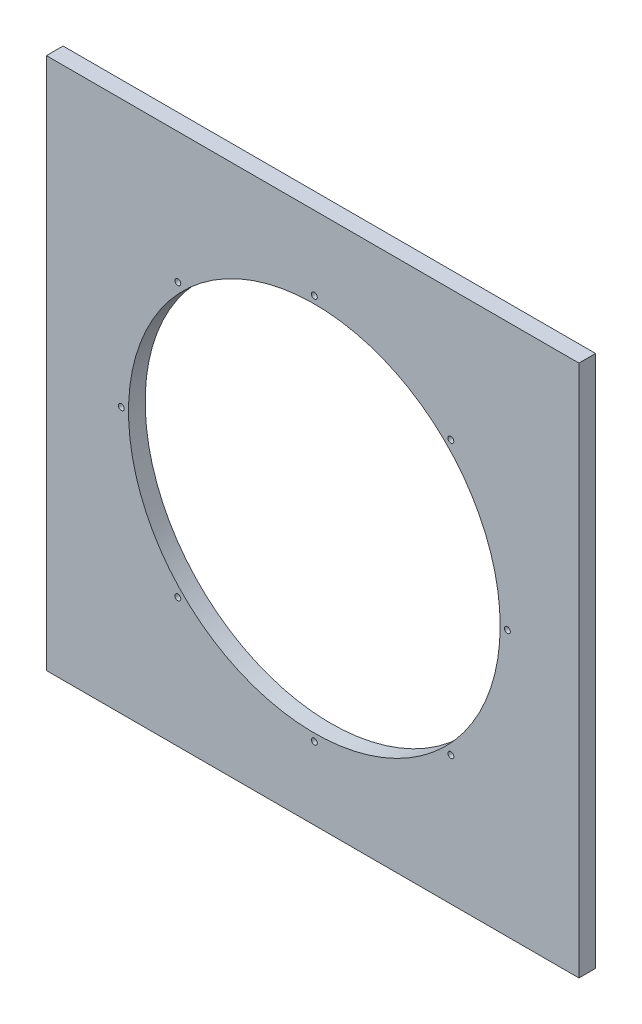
ISO-10303-21;
HEADER;
FILE_DESCRIPTION(('STEP AP214'),'2;1');
FILE_NAME('part.step','',(''),(''),'','','');
FILE_SCHEMA(('AUTOMOTIVE_DESIGN { 1 0 10303 214 1 1 1 1 }'));
ENDSEC;
DATA;
#1=APPLICATION_CONTEXT('core data for automotive mechanical design processes');
#2=APPLICATION_PROTOCOL_DEFINITION('international standard','automotive_design',2000,#1);
#3=PRODUCT_CONTEXT('',#1,'mechanical');
#4=PRODUCT('Part','Part','',(#3));
#5=PRODUCT_RELATED_PRODUCT_CATEGORY('part','',(#4));
#6=PRODUCT_DEFINITION_FORMATION('','',#4);
#7=PRODUCT_DEFINITION_CONTEXT('part definition',#1,'design');
#8=PRODUCT_DEFINITION('design','',#6,#7);
#9=PRODUCT_DEFINITION_SHAPE('','',#8);
#10=(LENGTH_UNIT() NAMED_UNIT(*) SI_UNIT(.MILLI.,.METRE.));
#11=(NAMED_UNIT(*) PLANE_ANGLE_UNIT() SI_UNIT($,.RADIAN.));
#12=(NAMED_UNIT(*) SI_UNIT($,.STERADIAN.) SOLID_ANGLE_UNIT());
#13=UNCERTAINTY_MEASURE_WITH_UNIT(LENGTH_MEASURE(1.E-05),#10,'distance_accuracy_value','');
#14=(GEOMETRIC_REPRESENTATION_CONTEXT(3) GLOBAL_UNCERTAINTY_ASSIGNED_CONTEXT((#13)) GLOBAL_UNIT_ASSIGNED_CONTEXT((#10,
#11,#12)) REPRESENTATION_CONTEXT('',''));
#15=CARTESIAN_POINT('',(0.,0.,0.));
#16=DIRECTION('',(0.,0.,1.));
#17=DIRECTION('',(1.,0.,0.));
#18=AXIS2_PLACEMENT_3D('',#15,#16,#17);
#19=CARTESIAN_POINT('',(304.8,304.8,19.05));
#20=DIRECTION('',(-1.,0.,0.));
#21=DIRECTION('',(0.,-1.,0.));
#22=AXIS2_PLACEMENT_3D('',#19,#20,#21);
#23=PLANE('',#22);
#24=DIRECTION('',(0.,1.,0.));
#25=VECTOR('',#24,1.);
#26=CARTESIAN_POINT('',(304.8,304.8,0.));
#27=LINE('',#26,#25);
#28=CARTESIAN_POINT('',(304.8,-304.8,0.));
#29=VERTEX_POINT('',#28);
#30=CARTESIAN_POINT('',(304.8,304.8,0.));
#31=VERTEX_POINT('',#30);
#32=EDGE_CURVE('E96',#29,#31,#27,.T.);
#33=ORIENTED_EDGE('',*,*,#32,.T.);
#34=DIRECTION('',(0.,0.,-1.));
#35=VECTOR('',#34,1.);
#36=CARTESIAN_POINT('',(304.8,304.8,19.05));
#37=LINE('',#36,#35);
#38=CARTESIAN_POINT('',(304.8,304.8,19.05));
#39=VERTEX_POINT('',#38);
#40=EDGE_CURVE('E11',#39,#31,#37,.T.);
#41=ORIENTED_EDGE('',*,*,#40,.F.);
#42=DIRECTION('',(0.,1.,0.));
#43=VECTOR('',#42,1.);
#44=CARTESIAN_POINT('',(304.8,304.8,19.05));
#45=LINE('',#44,#43);
#46=CARTESIAN_POINT('',(304.8,-304.8,19.05));
#47=VERTEX_POINT('',#46);
#48=EDGE_CURVE('E84',#47,#39,#45,.T.);
#49=ORIENTED_EDGE('',*,*,#48,.F.);
#50=DIRECTION('',(0.,0.,-1.));
#51=VECTOR('',#50,1.);
#52=CARTESIAN_POINT('',(304.8,-304.8,19.05));
#53=LINE('',#52,#51);
#54=EDGE_CURVE('E92',#47,#29,#53,.T.);
#55=ORIENTED_EDGE('',*,*,#54,.T.);
#56=EDGE_LOOP('',(#33,#41,#49,#55));
#57=FACE_BOUND('',#56,.T.);
#58=ADVANCED_FACE('F33',(#57),#23,.F.);
#59=CARTESIAN_POINT('',(-304.8,304.8,19.05));
#60=DIRECTION('',(0.,-1.,0.));
#61=DIRECTION('',(0.,0.,-1.));
#62=AXIS2_PLACEMENT_3D('',#59,#60,#61);
#63=PLANE('',#62);
#64=DIRECTION('',(-1.,0.,0.));
#65=VECTOR('',#64,1.);
#66=CARTESIAN_POINT('',(-304.8,304.8,0.));
#67=LINE('',#66,#65);
#68=CARTESIAN_POINT('',(-304.8,304.8,0.));
#69=VERTEX_POINT('',#68);
#70=EDGE_CURVE('E88',#31,#69,#67,.T.);
#71=ORIENTED_EDGE('',*,*,#70,.T.);
#72=DIRECTION('',(0.,0.,-1.));
#73=VECTOR('',#72,1.);
#74=CARTESIAN_POINT('',(-304.8,304.8,19.05));
#75=LINE('',#74,#73);
#76=CARTESIAN_POINT('',(-304.8,304.8,19.05));
#77=VERTEX_POINT('',#76);
#78=EDGE_CURVE('E41',#77,#69,#75,.T.);
#79=ORIENTED_EDGE('',*,*,#78,.F.);
#80=DIRECTION('',(-1.,0.,0.));
#81=VECTOR('',#80,1.);
#82=CARTESIAN_POINT('',(-304.8,304.8,19.05));
#83=LINE('',#82,#81);
#84=EDGE_CURVE('E79',#39,#77,#83,.T.);
#85=ORIENTED_EDGE('',*,*,#84,.F.);
#86=ORIENTED_EDGE('',*,*,#40,.T.);
#87=EDGE_LOOP('',(#71,#79,#85,#86));
#88=FACE_BOUND('',#87,.T.);
#89=ADVANCED_FACE('F87',(#88),#63,.F.);
#90=CARTESIAN_POINT('',(-304.8,304.8,19.05));
#91=DIRECTION('',(1.,0.,0.));
#92=DIRECTION('',(0.,1.,0.));
#93=AXIS2_PLACEMENT_3D('',#90,#91,#92);
#94=PLANE('',#93);
#95=DIRECTION('',(0.,-1.,0.));
#96=VECTOR('',#95,1.);
#97=CARTESIAN_POINT('',(-304.8,304.8,0.));
#98=LINE('',#97,#96);
#99=CARTESIAN_POINT('',(-304.8,-304.8,0.));
#100=VERTEX_POINT('',#99);
#101=EDGE_CURVE('E66',#69,#100,#98,.T.);
#102=ORIENTED_EDGE('',*,*,#101,.T.);
#103=DIRECTION('',(0.,0.,-1.));
#104=VECTOR('',#103,1.);
#105=CARTESIAN_POINT('',(-304.8,-304.8,19.05));
#106=LINE('',#105,#104);
#107=CARTESIAN_POINT('',(-304.8,-304.8,19.05));
#108=VERTEX_POINT('',#107);
#109=EDGE_CURVE('E89',#108,#100,#106,.T.);
#110=ORIENTED_EDGE('',*,*,#109,.F.);
#111=DIRECTION('',(0.,-1.,0.));
#112=VECTOR('',#111,1.);
#113=CARTESIAN_POINT('',(-304.8,304.8,19.05));
#114=LINE('',#113,#112);
#115=EDGE_CURVE('E82',#77,#108,#114,.T.);
#116=ORIENTED_EDGE('',*,*,#115,.F.);
#117=ORIENTED_EDGE('',*,*,#78,.T.);
#118=EDGE_LOOP('',(#102,#110,#116,#117));
#119=FACE_BOUND('',#118,.T.);
#120=ADVANCED_FACE('F90',(#119),#94,.F.);
#121=CARTESIAN_POINT('',(-304.8,-304.8,19.05));
#122=DIRECTION('',(0.,1.,0.));
#123=DIRECTION('',(0.,0.,1.));
#124=AXIS2_PLACEMENT_3D('',#121,#122,#123);
#125=PLANE('',#124);
#126=DIRECTION('',(1.,0.,0.));
#127=VECTOR('',#126,1.);
#128=CARTESIAN_POINT('',(-304.8,-304.8,0.));
#129=LINE('',#128,#127);
#130=EDGE_CURVE('E72',#100,#29,#129,.T.);
#131=ORIENTED_EDGE('',*,*,#130,.T.);
#132=ORIENTED_EDGE('',*,*,#54,.F.);
#133=DIRECTION('',(1.,0.,0.));
#134=VECTOR('',#133,1.);
#135=CARTESIAN_POINT('',(-304.8,-304.8,19.05));
#136=LINE('',#135,#134);
#137=EDGE_CURVE('E49',#108,#47,#136,.T.);
#138=ORIENTED_EDGE('',*,*,#137,.F.);
#139=ORIENTED_EDGE('',*,*,#109,.T.);
#140=EDGE_LOOP('',(#131,#132,#138,#139));
#141=FACE_BOUND('',#140,.T.);
#142=ADVANCED_FACE('F104',(#141),#125,.F.);
#143=CARTESIAN_POINT('',(0.,0.,19.05));
#144=DIRECTION('',(0.,0.,1.));
#145=DIRECTION('',(1.,0.,0.));
#146=AXIS2_PLACEMENT_3D('',#143,#144,#145);
#147=PLANE('',#146);
#148=CARTESIAN_POINT('',(-154.361699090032,155.507174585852,19.05));
#149=DIRECTION('',(0.,0.,1.));
#150=DIRECTION('',(1.,0.,0.));
#151=AXIS2_PLACEMENT_3D('',#148,#149,#150);
#152=CIRCLE('',#151,3.36549999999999);
#153=CARTESIAN_POINT('',(-150.996199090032,155.507174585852,19.05));
#154=VERTEX_POINT('',#153);
#155=EDGE_CURVE('E158',#154,#154,#152,.T.);
#156=ORIENTED_EDGE('',*,*,#155,.F.);
#157=EDGE_LOOP('',(#156));
#158=FACE_BOUND('',#157,.T.);
#159=CARTESIAN_POINT('',(-219.091194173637,-0.763650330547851,19.05));
#160=DIRECTION('',(0.,0.,1.));
#161=DIRECTION('',(1.,0.,0.));
#162=AXIS2_PLACEMENT_3D('',#159,#160,#161);
#163=CIRCLE('',#162,3.36549999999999);
#164=CARTESIAN_POINT('',(-215.725694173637,-0.763650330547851,19.05));
#165=VERTEX_POINT('',#164);
#166=EDGE_CURVE('E152',#165,#165,#163,.T.);
#167=ORIENTED_EDGE('',*,*,#166,.F.);
#168=EDGE_LOOP('',(#167));
#169=FACE_BOUND('',#168,.T.);
#170=CARTESIAN_POINT('',(-154.361699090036,-157.034475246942,19.05));
#171=DIRECTION('',(0.,0.,1.));
#172=DIRECTION('',(1.,0.,0.));
#173=AXIS2_PLACEMENT_3D('',#170,#171,#172);
#174=CIRCLE('',#173,3.36549999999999);
#175=CARTESIAN_POINT('',(-150.996199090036,-157.034475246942,19.05));
#176=VERTEX_POINT('',#175);
#177=EDGE_CURVE('E146',#176,#176,#174,.T.);
#178=ORIENTED_EDGE('',*,*,#177,.F.);
#179=EDGE_LOOP('',(#178));
#180=FACE_BOUND('',#179,.T.);
#181=CARTESIAN_POINT('',(1.90912582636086,-221.763970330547,19.05));
#182=DIRECTION('',(0.,0.,1.));
#183=DIRECTION('',(1.,0.,0.));
#184=AXIS2_PLACEMENT_3D('',#181,#182,#183);
#185=CIRCLE('',#184,3.3655);
#186=CARTESIAN_POINT('',(5.27462582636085,-221.763970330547,19.05));
#187=VERTEX_POINT('',#186);
#188=EDGE_CURVE('E140',#187,#187,#185,.T.);
#189=ORIENTED_EDGE('',*,*,#188,.F.);
#190=EDGE_LOOP('',(#189));
#191=FACE_BOUND('',#190,.T.);
#192=CARTESIAN_POINT('',(158.17995074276,-157.034475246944,19.05));
#193=DIRECTION('',(0.,0.,1.));
#194=DIRECTION('',(1.,0.,0.));
#195=AXIS2_PLACEMENT_3D('',#192,#193,#194);
#196=CIRCLE('',#195,3.36549999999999);
#197=CARTESIAN_POINT('',(161.54545074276,-157.034475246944,19.05));
#198=VERTEX_POINT('',#197);
#199=EDGE_CURVE('E134',#198,#198,#196,.T.);
#200=ORIENTED_EDGE('',*,*,#199,.F.);
#201=EDGE_LOOP('',(#200));
#202=FACE_BOUND('',#201,.T.);
#203=CARTESIAN_POINT('',(222.909445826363,-0.763650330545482,19.05));
#204=DIRECTION('',(0.,0.,1.));
#205=DIRECTION('',(1.,0.,0.));
#206=AXIS2_PLACEMENT_3D('',#203,#204,#205);
#207=CIRCLE('',#206,3.36549999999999);
#208=CARTESIAN_POINT('',(226.274945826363,-0.763650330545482,19.05));
#209=VERTEX_POINT('',#208);
#210=EDGE_CURVE('E128',#209,#209,#207,.T.);
#211=ORIENTED_EDGE('',*,*,#210,.F.);
#212=EDGE_LOOP('',(#211));
#213=FACE_BOUND('',#212,.T.);
#214=CARTESIAN_POINT('',(158.17995074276,155.50717458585,19.05));
#215=DIRECTION('',(0.,0.,1.));
#216=DIRECTION('',(1.,0.,0.));
#217=AXIS2_PLACEMENT_3D('',#214,#215,#216);
#218=CIRCLE('',#217,3.36549999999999);
#219=CARTESIAN_POINT('',(161.54545074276,155.50717458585,19.05));
#220=VERTEX_POINT('',#219);
#221=EDGE_CURVE('E122',#220,#220,#218,.T.);
#222=ORIENTED_EDGE('',*,*,#221,.F.);
#223=EDGE_LOOP('',(#222));
#224=FACE_BOUND('',#223,.T.);
#225=CARTESIAN_POINT('',(1.90912582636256,-0.763650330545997,19.05));
#226=DIRECTION('',(0.,0.,1.));
#227=DIRECTION('',(1.,0.,0.));
#228=AXIS2_PLACEMENT_3D('',#225,#226,#227);
#229=CIRCLE('',#228,212.725);
#230=CARTESIAN_POINT('',(214.634125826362,-0.763650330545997,19.05));
#231=VERTEX_POINT('',#230);
#232=EDGE_CURVE('E116',#231,#231,#229,.T.);
#233=ORIENTED_EDGE('',*,*,#232,.F.);
#234=EDGE_LOOP('',(#233));
#235=FACE_BOUND('',#234,.T.);
#236=CARTESIAN_POINT('',(1.90912582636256,220.236669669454,19.05));
#237=DIRECTION('',(0.,0.,1.));
#238=DIRECTION('',(1.,0.,0.));
#239=AXIS2_PLACEMENT_3D('',#236,#237,#238);
#240=CIRCLE('',#239,3.3655);
#241=CARTESIAN_POINT('',(5.27462582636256,220.236669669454,19.05));
#242=VERTEX_POINT('',#241);
#243=EDGE_CURVE('E110',#242,#242,#240,.T.);
#244=ORIENTED_EDGE('',*,*,#243,.F.);
#245=EDGE_LOOP('',(#244));
#246=FACE_BOUND('',#245,.T.);
#247=ORIENTED_EDGE('',*,*,#48,.T.);
#248=ORIENTED_EDGE('',*,*,#84,.T.);
#249=ORIENTED_EDGE('',*,*,#115,.T.);
#250=ORIENTED_EDGE('',*,*,#137,.T.);
#251=EDGE_LOOP('',(#247,#248,#249,#250));
#252=FACE_BOUND('',#251,.T.);
#253=ADVANCED_FACE('F80',(#158,#169,#180,#191,#202,#213,#224,#235,#246,#252),#147,.T.);
#254=CARTESIAN_POINT('',(0.,0.,0.));
#255=DIRECTION('',(0.,0.,1.));
#256=DIRECTION('',(1.,0.,0.));
#257=AXIS2_PLACEMENT_3D('',#254,#255,#256);
#258=PLANE('',#257);
#259=CARTESIAN_POINT('',(-154.361699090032,155.507174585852,0.));
#260=DIRECTION('',(0.,0.,1.));
#261=DIRECTION('',(1.,0.,0.));
#262=AXIS2_PLACEMENT_3D('',#259,#260,#261);
#263=CIRCLE('',#262,3.36549999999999);
#264=CARTESIAN_POINT('',(-150.996199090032,155.507174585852,0.));
#265=VERTEX_POINT('',#264);
#266=EDGE_CURVE('E155',#265,#265,#263,.T.);
#267=ORIENTED_EDGE('',*,*,#266,.T.);
#268=EDGE_LOOP('',(#267));
#269=FACE_BOUND('',#268,.T.);
#270=CARTESIAN_POINT('',(-219.091194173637,-0.763650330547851,0.));
#271=DIRECTION('',(0.,0.,1.));
#272=DIRECTION('',(1.,0.,0.));
#273=AXIS2_PLACEMENT_3D('',#270,#271,#272);
#274=CIRCLE('',#273,3.36549999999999);
#275=CARTESIAN_POINT('',(-215.725694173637,-0.763650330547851,0.));
#276=VERTEX_POINT('',#275);
#277=EDGE_CURVE('E149',#276,#276,#274,.T.);
#278=ORIENTED_EDGE('',*,*,#277,.T.);
#279=EDGE_LOOP('',(#278));
#280=FACE_BOUND('',#279,.T.);
#281=CARTESIAN_POINT('',(-154.361699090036,-157.034475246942,0.));
#282=DIRECTION('',(0.,0.,1.));
#283=DIRECTION('',(1.,0.,0.));
#284=AXIS2_PLACEMENT_3D('',#281,#282,#283);
#285=CIRCLE('',#284,3.36549999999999);
#286=CARTESIAN_POINT('',(-150.996199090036,-157.034475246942,0.));
#287=VERTEX_POINT('',#286);
#288=EDGE_CURVE('E143',#287,#287,#285,.T.);
#289=ORIENTED_EDGE('',*,*,#288,.T.);
#290=EDGE_LOOP('',(#289));
#291=FACE_BOUND('',#290,.T.);
#292=CARTESIAN_POINT('',(1.90912582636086,-221.763970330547,0.));
#293=DIRECTION('',(0.,0.,1.));
#294=DIRECTION('',(1.,0.,0.));
#295=AXIS2_PLACEMENT_3D('',#292,#293,#294);
#296=CIRCLE('',#295,3.3655);
#297=CARTESIAN_POINT('',(5.27462582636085,-221.763970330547,0.));
#298=VERTEX_POINT('',#297);
#299=EDGE_CURVE('E137',#298,#298,#296,.T.);
#300=ORIENTED_EDGE('',*,*,#299,.T.);
#301=EDGE_LOOP('',(#300));
#302=FACE_BOUND('',#301,.T.);
#303=CARTESIAN_POINT('',(158.17995074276,-157.034475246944,0.));
#304=DIRECTION('',(0.,0.,1.));
#305=DIRECTION('',(1.,0.,0.));
#306=AXIS2_PLACEMENT_3D('',#303,#304,#305);
#307=CIRCLE('',#306,3.36549999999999);
#308=CARTESIAN_POINT('',(161.54545074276,-157.034475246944,0.));
#309=VERTEX_POINT('',#308);
#310=EDGE_CURVE('E131',#309,#309,#307,.T.);
#311=ORIENTED_EDGE('',*,*,#310,.T.);
#312=EDGE_LOOP('',(#311));
#313=FACE_BOUND('',#312,.T.);
#314=CARTESIAN_POINT('',(222.909445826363,-0.763650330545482,0.));
#315=DIRECTION('',(0.,0.,1.));
#316=DIRECTION('',(1.,0.,0.));
#317=AXIS2_PLACEMENT_3D('',#314,#315,#316);
#318=CIRCLE('',#317,3.36549999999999);
#319=CARTESIAN_POINT('',(226.274945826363,-0.763650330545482,0.));
#320=VERTEX_POINT('',#319);
#321=EDGE_CURVE('E125',#320,#320,#318,.T.);
#322=ORIENTED_EDGE('',*,*,#321,.T.);
#323=EDGE_LOOP('',(#322));
#324=FACE_BOUND('',#323,.T.);
#325=CARTESIAN_POINT('',(158.17995074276,155.50717458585,0.));
#326=DIRECTION('',(0.,0.,1.));
#327=DIRECTION('',(1.,0.,0.));
#328=AXIS2_PLACEMENT_3D('',#325,#326,#327);
#329=CIRCLE('',#328,3.36549999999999);
#330=CARTESIAN_POINT('',(161.54545074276,155.50717458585,0.));
#331=VERTEX_POINT('',#330);
#332=EDGE_CURVE('E119',#331,#331,#329,.T.);
#333=ORIENTED_EDGE('',*,*,#332,.T.);
#334=EDGE_LOOP('',(#333));
#335=FACE_BOUND('',#334,.T.);
#336=CARTESIAN_POINT('',(1.90912582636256,-0.763650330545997,0.));
#337=DIRECTION('',(0.,0.,1.));
#338=DIRECTION('',(1.,0.,0.));
#339=AXIS2_PLACEMENT_3D('',#336,#337,#338);
#340=CIRCLE('',#339,212.725);
#341=CARTESIAN_POINT('',(214.634125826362,-0.763650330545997,0.));
#342=VERTEX_POINT('',#341);
#343=EDGE_CURVE('E113',#342,#342,#340,.T.);
#344=ORIENTED_EDGE('',*,*,#343,.T.);
#345=EDGE_LOOP('',(#344));
#346=FACE_BOUND('',#345,.T.);
#347=CARTESIAN_POINT('',(1.90912582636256,220.236669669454,0.));
#348=DIRECTION('',(0.,0.,1.));
#349=DIRECTION('',(1.,0.,0.));
#350=AXIS2_PLACEMENT_3D('',#347,#348,#349);
#351=CIRCLE('',#350,3.3655);
#352=CARTESIAN_POINT('',(5.27462582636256,220.236669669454,0.));
#353=VERTEX_POINT('',#352);
#354=EDGE_CURVE('E99',#353,#353,#351,.T.);
#355=ORIENTED_EDGE('',*,*,#354,.T.);
#356=EDGE_LOOP('',(#355));
#357=FACE_BOUND('',#356,.T.);
#358=ORIENTED_EDGE('',*,*,#32,.F.);
#359=ORIENTED_EDGE('',*,*,#130,.F.);
#360=ORIENTED_EDGE('',*,*,#101,.F.);
#361=ORIENTED_EDGE('',*,*,#70,.F.);
#362=EDGE_LOOP('',(#358,#359,#360,#361));
#363=FACE_BOUND('',#362,.T.);
#364=ADVANCED_FACE('F107',(#269,#280,#291,#302,#313,#324,#335,#346,#357,#363),#258,.F.);
#365=CARTESIAN_POINT('',(1.90912582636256,220.236669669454,0.));
#366=DIRECTION('',(0.,0.,1.));
#367=DIRECTION('',(1.,0.,0.));
#368=AXIS2_PLACEMENT_3D('',#365,#366,#367);
#369=CYLINDRICAL_SURFACE('',#368,3.3655);
#370=CARTESIAN_POINT('',(5.27462582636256,220.236669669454,0.));
#371=CARTESIAN_POINT('',(5.27462582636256,220.236669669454,0.1984375));
#372=CARTESIAN_POINT('',(5.27462582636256,220.236669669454,0.396875));
#373=CARTESIAN_POINT('',(5.27462582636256,220.236669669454,0.79375));
#374=CARTESIAN_POINT('',(5.27462582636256,220.236669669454,0.9921875));
#375=CARTESIAN_POINT('',(5.27462582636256,220.236669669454,1.3890625));
#376=CARTESIAN_POINT('',(5.27462582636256,220.236669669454,1.5875));
#377=CARTESIAN_POINT('',(5.27462582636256,220.236669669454,1.984375));
#378=CARTESIAN_POINT('',(5.27462582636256,220.236669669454,2.1828125));
#379=CARTESIAN_POINT('',(5.27462582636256,220.236669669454,2.5796875));
#380=CARTESIAN_POINT('',(5.27462582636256,220.236669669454,2.778125));
#381=CARTESIAN_POINT('',(5.27462582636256,220.236669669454,3.175));
#382=CARTESIAN_POINT('',(5.27462582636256,220.236669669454,3.3734375));
#383=CARTESIAN_POINT('',(5.27462582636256,220.236669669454,3.7703125));
#384=CARTESIAN_POINT('',(5.27462582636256,220.236669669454,3.96875));
#385=CARTESIAN_POINT('',(5.27462582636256,220.236669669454,4.365625));
#386=CARTESIAN_POINT('',(5.27462582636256,220.236669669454,4.5640625));
#387=CARTESIAN_POINT('',(5.27462582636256,220.236669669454,4.9609375));
#388=CARTESIAN_POINT('',(5.27462582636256,220.236669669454,5.159375));
#389=CARTESIAN_POINT('',(5.27462582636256,220.236669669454,5.55625));
#390=CARTESIAN_POINT('',(5.27462582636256,220.236669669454,5.7546875));
#391=CARTESIAN_POINT('',(5.27462582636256,220.236669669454,6.1515625));
#392=CARTESIAN_POINT('',(5.27462582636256,220.236669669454,6.35));
#393=CARTESIAN_POINT('',(5.27462582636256,220.236669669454,6.746875));
#394=CARTESIAN_POINT('',(5.27462582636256,220.236669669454,6.9453125));
#395=CARTESIAN_POINT('',(5.27462582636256,220.236669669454,7.3421875));
#396=CARTESIAN_POINT('',(5.27462582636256,220.236669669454,7.540625));
#397=CARTESIAN_POINT('',(5.27462582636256,220.236669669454,7.9375));
#398=CARTESIAN_POINT('',(5.27462582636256,220.236669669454,8.1359375));
#399=CARTESIAN_POINT('',(5.27462582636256,220.236669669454,8.5328125));
#400=CARTESIAN_POINT('',(5.27462582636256,220.236669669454,8.73125));
#401=CARTESIAN_POINT('',(5.27462582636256,220.236669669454,9.128125));
#402=CARTESIAN_POINT('',(5.27462582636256,220.236669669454,9.3265625));
#403=CARTESIAN_POINT('',(5.27462582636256,220.236669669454,9.7234375));
#404=CARTESIAN_POINT('',(5.27462582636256,220.236669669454,9.921875));
#405=CARTESIAN_POINT('',(5.27462582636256,220.236669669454,10.31875));
#406=CARTESIAN_POINT('',(5.27462582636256,220.236669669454,10.5171875));
#407=CARTESIAN_POINT('',(5.27462582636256,220.236669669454,10.9140625));
#408=CARTESIAN_POINT('',(5.27462582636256,220.236669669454,11.1125));
#409=CARTESIAN_POINT('',(5.27462582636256,220.236669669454,11.509375));
#410=CARTESIAN_POINT('',(5.27462582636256,220.236669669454,11.7078125));
#411=CARTESIAN_POINT('',(5.27462582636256,220.236669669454,12.1046875));
#412=CARTESIAN_POINT('',(5.27462582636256,220.236669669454,12.303125));
#413=CARTESIAN_POINT('',(5.27462582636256,220.236669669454,12.7));
#414=CARTESIAN_POINT('',(5.27462582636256,220.236669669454,12.8984375));
#415=CARTESIAN_POINT('',(5.27462582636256,220.236669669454,13.2953125));
#416=CARTESIAN_POINT('',(5.27462582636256,220.236669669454,13.49375));
#417=CARTESIAN_POINT('',(5.27462582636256,220.236669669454,13.890625));
#418=CARTESIAN_POINT('',(5.27462582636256,220.236669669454,14.0890625));
#419=CARTESIAN_POINT('',(5.27462582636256,220.236669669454,14.4859375));
#420=CARTESIAN_POINT('',(5.27462582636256,220.236669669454,14.684375));
#421=CARTESIAN_POINT('',(5.27462582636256,220.236669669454,15.08125));
#422=CARTESIAN_POINT('',(5.27462582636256,220.236669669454,15.2796875));
#423=CARTESIAN_POINT('',(5.27462582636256,220.236669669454,15.6765625));
#424=CARTESIAN_POINT('',(5.27462582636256,220.236669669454,15.875));
#425=CARTESIAN_POINT('',(5.27462582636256,220.236669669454,16.271875));
#426=CARTESIAN_POINT('',(5.27462582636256,220.236669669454,16.4703125));
#427=CARTESIAN_POINT('',(5.27462582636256,220.236669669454,16.8671875));
#428=CARTESIAN_POINT('',(5.27462582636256,220.236669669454,17.065625));
#429=CARTESIAN_POINT('',(5.27462582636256,220.236669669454,17.4625));
#430=CARTESIAN_POINT('',(5.27462582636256,220.236669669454,17.6609375));
#431=CARTESIAN_POINT('',(5.27462582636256,220.236669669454,18.0578125));
#432=CARTESIAN_POINT('',(5.27462582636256,220.236669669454,18.25625));
#433=CARTESIAN_POINT('',(5.27462582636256,220.236669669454,18.653125));
#434=CARTESIAN_POINT('',(5.27462582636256,220.236669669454,18.8515625));
#435=CARTESIAN_POINT('',(5.27462582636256,220.236669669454,19.05));
#436=B_SPLINE_CURVE_WITH_KNOTS('',3,(#370,#371,#372,#373,#374,#375,#376,#377,#378,#379,#380,
#381,#382,#383,#384,#385,#386,#387,#388,#389,#390,#391,#392,#393,#394,#395,#396,#397,#398,#399,
#400,#401,#402,#403,#404,#405,#406,#407,#408,#409,#410,#411,#412,#413,#414,#415,#416,#417,#418,
#419,#420,#421,#422,#423,#424,#425,#426,#427,#428,#429,#430,#431,#432,#433,#434,#435),
.UNSPECIFIED.,.F.,.F.,(4,2,2,2,2,2,2,2,2,2,2,2,2,2,2,2,2,2,2,2,2,2,2,2,2,2,2,2,2,2,2,2,4),(0.,
0.5953125,1.190625,1.7859375,2.38125,2.9765625,3.571875,4.1671875,4.7625,5.3578125,5.953125,
6.5484375,7.14375,7.7390625,8.334375,8.9296875,9.525,10.1203125,10.715625,11.3109375,11.90625,
12.5015625,13.096875,13.6921875,14.2875,14.8828125,15.478125,16.0734375,16.66875,17.2640625,
17.859375,18.4546875,19.05),.UNSPECIFIED.);
#437=EDGE_CURVE('BSEAM192',#353,#242,#436,.T.);
#438=ORIENTED_EDGE('',*,*,#354,.F.);
#439=ORIENTED_EDGE('',*,*,#243,.T.);
#440=ORIENTED_EDGE('',*,*,#437,.T.);
#441=ORIENTED_EDGE('',*,*,#437,.F.);
#442=EDGE_LOOP('',(#438,#440,#439,#441));
#443=FACE_BOUND('',#442,.T.);
#444=ADVANCED_FACE('F192',(#443),#369,.F.);
#445=CARTESIAN_POINT('',(1.90912582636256,-0.763650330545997,0.));
#446=DIRECTION('',(0.,0.,1.));
#447=DIRECTION('',(1.,0.,0.));
#448=AXIS2_PLACEMENT_3D('',#445,#446,#447);
#449=CYLINDRICAL_SURFACE('',#448,212.725);
#450=CARTESIAN_POINT('',(214.634125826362,-0.763650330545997,0.));
#451=CARTESIAN_POINT('',(214.634125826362,-0.763650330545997,0.1984375));
#452=CARTESIAN_POINT('',(214.634125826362,-0.763650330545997,0.396875));
#453=CARTESIAN_POINT('',(214.634125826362,-0.763650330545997,0.79375));
#454=CARTESIAN_POINT('',(214.634125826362,-0.763650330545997,0.9921875));
#455=CARTESIAN_POINT('',(214.634125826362,-0.763650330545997,1.3890625));
#456=CARTESIAN_POINT('',(214.634125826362,-0.763650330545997,1.5875));
#457=CARTESIAN_POINT('',(214.634125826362,-0.763650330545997,1.984375));
#458=CARTESIAN_POINT('',(214.634125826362,-0.763650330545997,2.1828125));
#459=CARTESIAN_POINT('',(214.634125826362,-0.763650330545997,2.5796875));
#460=CARTESIAN_POINT('',(214.634125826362,-0.763650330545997,2.778125));
#461=CARTESIAN_POINT('',(214.634125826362,-0.763650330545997,3.175));
#462=CARTESIAN_POINT('',(214.634125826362,-0.763650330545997,3.3734375));
#463=CARTESIAN_POINT('',(214.634125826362,-0.763650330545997,3.7703125));
#464=CARTESIAN_POINT('',(214.634125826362,-0.763650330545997,3.96875));
#465=CARTESIAN_POINT('',(214.634125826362,-0.763650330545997,4.365625));
#466=CARTESIAN_POINT('',(214.634125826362,-0.763650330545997,4.5640625));
#467=CARTESIAN_POINT('',(214.634125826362,-0.763650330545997,4.9609375));
#468=CARTESIAN_POINT('',(214.634125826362,-0.763650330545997,5.159375));
#469=CARTESIAN_POINT('',(214.634125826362,-0.763650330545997,5.55625));
#470=CARTESIAN_POINT('',(214.634125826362,-0.763650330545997,5.7546875));
#471=CARTESIAN_POINT('',(214.634125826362,-0.763650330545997,6.1515625));
#472=CARTESIAN_POINT('',(214.634125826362,-0.763650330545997,6.35));
#473=CARTESIAN_POINT('',(214.634125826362,-0.763650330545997,6.746875));
#474=CARTESIAN_POINT('',(214.634125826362,-0.763650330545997,6.9453125));
#475=CARTESIAN_POINT('',(214.634125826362,-0.763650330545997,7.3421875));
#476=CARTESIAN_POINT('',(214.634125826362,-0.763650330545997,7.540625));
#477=CARTESIAN_POINT('',(214.634125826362,-0.763650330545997,7.9375));
#478=CARTESIAN_POINT('',(214.634125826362,-0.763650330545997,8.1359375));
#479=CARTESIAN_POINT('',(214.634125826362,-0.763650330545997,8.5328125));
#480=CARTESIAN_POINT('',(214.634125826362,-0.763650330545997,8.73125));
#481=CARTESIAN_POINT('',(214.634125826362,-0.763650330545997,9.128125));
#482=CARTESIAN_POINT('',(214.634125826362,-0.763650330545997,9.3265625));
#483=CARTESIAN_POINT('',(214.634125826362,-0.763650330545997,9.7234375));
#484=CARTESIAN_POINT('',(214.634125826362,-0.763650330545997,9.921875));
#485=CARTESIAN_POINT('',(214.634125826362,-0.763650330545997,10.31875));
#486=CARTESIAN_POINT('',(214.634125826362,-0.763650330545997,10.5171875));
#487=CARTESIAN_POINT('',(214.634125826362,-0.763650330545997,10.9140625));
#488=CARTESIAN_POINT('',(214.634125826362,-0.763650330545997,11.1125));
#489=CARTESIAN_POINT('',(214.634125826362,-0.763650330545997,11.509375));
#490=CARTESIAN_POINT('',(214.634125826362,-0.763650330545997,11.7078125));
#491=CARTESIAN_POINT('',(214.634125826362,-0.763650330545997,12.1046875));
#492=CARTESIAN_POINT('',(214.634125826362,-0.763650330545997,12.303125));
#493=CARTESIAN_POINT('',(214.634125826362,-0.763650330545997,12.7));
#494=CARTESIAN_POINT('',(214.634125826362,-0.763650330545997,12.8984375));
#495=CARTESIAN_POINT('',(214.634125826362,-0.763650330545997,13.2953125));
#496=CARTESIAN_POINT('',(214.634125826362,-0.763650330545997,13.49375));
#497=CARTESIAN_POINT('',(214.634125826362,-0.763650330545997,13.890625));
#498=CARTESIAN_POINT('',(214.634125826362,-0.763650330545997,14.0890625));
#499=CARTESIAN_POINT('',(214.634125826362,-0.763650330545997,14.4859375));
#500=CARTESIAN_POINT('',(214.634125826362,-0.763650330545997,14.684375));
#501=CARTESIAN_POINT('',(214.634125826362,-0.763650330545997,15.08125));
#502=CARTESIAN_POINT('',(214.634125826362,-0.763650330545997,15.2796875));
#503=CARTESIAN_POINT('',(214.634125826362,-0.763650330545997,15.6765625));
#504=CARTESIAN_POINT('',(214.634125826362,-0.763650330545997,15.875));
#505=CARTESIAN_POINT('',(214.634125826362,-0.763650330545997,16.271875));
#506=CARTESIAN_POINT('',(214.634125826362,-0.763650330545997,16.4703125));
#507=CARTESIAN_POINT('',(214.634125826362,-0.763650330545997,16.8671875));
#508=CARTESIAN_POINT('',(214.634125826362,-0.763650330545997,17.065625));
#509=CARTESIAN_POINT('',(214.634125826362,-0.763650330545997,17.4625));
#510=CARTESIAN_POINT('',(214.634125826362,-0.763650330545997,17.6609375));
#511=CARTESIAN_POINT('',(214.634125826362,-0.763650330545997,18.0578125));
#512=CARTESIAN_POINT('',(214.634125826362,-0.763650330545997,18.25625));
#513=CARTESIAN_POINT('',(214.634125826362,-0.763650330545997,18.653125));
#514=CARTESIAN_POINT('',(214.634125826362,-0.763650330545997,18.8515625));
#515=CARTESIAN_POINT('',(214.634125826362,-0.763650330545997,19.05));
#516=B_SPLINE_CURVE_WITH_KNOTS('',3,(#450,#451,#452,#453,#454,#455,#456,#457,#458,#459,#460,
#461,#462,#463,#464,#465,#466,#467,#468,#469,#470,#471,#472,#473,#474,#475,#476,#477,#478,#479,
#480,#481,#482,#483,#484,#485,#486,#487,#488,#489,#490,#491,#492,#493,#494,#495,#496,#497,#498,
#499,#500,#501,#502,#503,#504,#505,#506,#507,#508,#509,#510,#511,#512,#513,#514,#515),
.UNSPECIFIED.,.F.,.F.,(4,2,2,2,2,2,2,2,2,2,2,2,2,2,2,2,2,2,2,2,2,2,2,2,2,2,2,2,2,2,2,2,4),(0.,
0.5953125,1.190625,1.7859375,2.38125,2.9765625,3.571875,4.1671875,4.7625,5.3578125,5.953125,
6.5484375,7.14375,7.7390625,8.334375,8.9296875,9.525,10.1203125,10.715625,11.3109375,11.90625,
12.5015625,13.096875,13.6921875,14.2875,14.8828125,15.478125,16.0734375,16.66875,17.2640625,
17.859375,18.4546875,19.05),.UNSPECIFIED.);
#517=EDGE_CURVE('BSEAM194',#342,#231,#516,.T.);
#518=ORIENTED_EDGE('',*,*,#343,.F.);
#519=ORIENTED_EDGE('',*,*,#232,.T.);
#520=ORIENTED_EDGE('',*,*,#517,.T.);
#521=ORIENTED_EDGE('',*,*,#517,.F.);
#522=EDGE_LOOP('',(#518,#520,#519,#521));
#523=FACE_BOUND('',#522,.T.);
#524=ADVANCED_FACE('F194',(#523),#449,.F.);
#525=CARTESIAN_POINT('',(158.17995074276,155.50717458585,0.));
#526=DIRECTION('',(0.,0.,1.));
#527=DIRECTION('',(1.,0.,0.));
#528=AXIS2_PLACEMENT_3D('',#525,#526,#527);
#529=CYLINDRICAL_SURFACE('',#528,3.36549999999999);
#530=CARTESIAN_POINT('',(161.54545074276,155.50717458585,0.));
#531=CARTESIAN_POINT('',(161.54545074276,155.50717458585,0.1984375));
#532=CARTESIAN_POINT('',(161.54545074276,155.50717458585,0.396875));
#533=CARTESIAN_POINT('',(161.54545074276,155.50717458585,0.79375));
#534=CARTESIAN_POINT('',(161.54545074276,155.50717458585,0.9921875));
#535=CARTESIAN_POINT('',(161.54545074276,155.50717458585,1.3890625));
#536=CARTESIAN_POINT('',(161.54545074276,155.50717458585,1.5875));
#537=CARTESIAN_POINT('',(161.54545074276,155.50717458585,1.984375));
#538=CARTESIAN_POINT('',(161.54545074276,155.50717458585,2.1828125));
#539=CARTESIAN_POINT('',(161.54545074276,155.50717458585,2.5796875));
#540=CARTESIAN_POINT('',(161.54545074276,155.50717458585,2.778125));
#541=CARTESIAN_POINT('',(161.54545074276,155.50717458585,3.175));
#542=CARTESIAN_POINT('',(161.54545074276,155.50717458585,3.3734375));
#543=CARTESIAN_POINT('',(161.54545074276,155.50717458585,3.7703125));
#544=CARTESIAN_POINT('',(161.54545074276,155.50717458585,3.96875));
#545=CARTESIAN_POINT('',(161.54545074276,155.50717458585,4.365625));
#546=CARTESIAN_POINT('',(161.54545074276,155.50717458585,4.5640625));
#547=CARTESIAN_POINT('',(161.54545074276,155.50717458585,4.9609375));
#548=CARTESIAN_POINT('',(161.54545074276,155.50717458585,5.159375));
#549=CARTESIAN_POINT('',(161.54545074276,155.50717458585,5.55625));
#550=CARTESIAN_POINT('',(161.54545074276,155.50717458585,5.7546875));
#551=CARTESIAN_POINT('',(161.54545074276,155.50717458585,6.1515625));
#552=CARTESIAN_POINT('',(161.54545074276,155.50717458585,6.35));
#553=CARTESIAN_POINT('',(161.54545074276,155.50717458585,6.746875));
#554=CARTESIAN_POINT('',(161.54545074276,155.50717458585,6.9453125));
#555=CARTESIAN_POINT('',(161.54545074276,155.50717458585,7.3421875));
#556=CARTESIAN_POINT('',(161.54545074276,155.50717458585,7.540625));
#557=CARTESIAN_POINT('',(161.54545074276,155.50717458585,7.9375));
#558=CARTESIAN_POINT('',(161.54545074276,155.50717458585,8.1359375));
#559=CARTESIAN_POINT('',(161.54545074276,155.50717458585,8.5328125));
#560=CARTESIAN_POINT('',(161.54545074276,155.50717458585,8.73125));
#561=CARTESIAN_POINT('',(161.54545074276,155.50717458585,9.128125));
#562=CARTESIAN_POINT('',(161.54545074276,155.50717458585,9.3265625));
#563=CARTESIAN_POINT('',(161.54545074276,155.50717458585,9.7234375));
#564=CARTESIAN_POINT('',(161.54545074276,155.50717458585,9.921875));
#565=CARTESIAN_POINT('',(161.54545074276,155.50717458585,10.31875));
#566=CARTESIAN_POINT('',(161.54545074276,155.50717458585,10.5171875));
#567=CARTESIAN_POINT('',(161.54545074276,155.50717458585,10.9140625));
#568=CARTESIAN_POINT('',(161.54545074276,155.50717458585,11.1125));
#569=CARTESIAN_POINT('',(161.54545074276,155.50717458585,11.509375));
#570=CARTESIAN_POINT('',(161.54545074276,155.50717458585,11.7078125));
#571=CARTESIAN_POINT('',(161.54545074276,155.50717458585,12.1046875));
#572=CARTESIAN_POINT('',(161.54545074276,155.50717458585,12.303125));
#573=CARTESIAN_POINT('',(161.54545074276,155.50717458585,12.7));
#574=CARTESIAN_POINT('',(161.54545074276,155.50717458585,12.8984375));
#575=CARTESIAN_POINT('',(161.54545074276,155.50717458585,13.2953125));
#576=CARTESIAN_POINT('',(161.54545074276,155.50717458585,13.49375));
#577=CARTESIAN_POINT('',(161.54545074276,155.50717458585,13.890625));
#578=CARTESIAN_POINT('',(161.54545074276,155.50717458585,14.0890625));
#579=CARTESIAN_POINT('',(161.54545074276,155.50717458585,14.4859375));
#580=CARTESIAN_POINT('',(161.54545074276,155.50717458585,14.684375));
#581=CARTESIAN_POINT('',(161.54545074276,155.50717458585,15.08125));
#582=CARTESIAN_POINT('',(161.54545074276,155.50717458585,15.2796875));
#583=CARTESIAN_POINT('',(161.54545074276,155.50717458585,15.6765625));
#584=CARTESIAN_POINT('',(161.54545074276,155.50717458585,15.875));
#585=CARTESIAN_POINT('',(161.54545074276,155.50717458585,16.271875));
#586=CARTESIAN_POINT('',(161.54545074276,155.50717458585,16.4703125));
#587=CARTESIAN_POINT('',(161.54545074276,155.50717458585,16.8671875));
#588=CARTESIAN_POINT('',(161.54545074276,155.50717458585,17.065625));
#589=CARTESIAN_POINT('',(161.54545074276,155.50717458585,17.4625));
#590=CARTESIAN_POINT('',(161.54545074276,155.50717458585,17.6609375));
#591=CARTESIAN_POINT('',(161.54545074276,155.50717458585,18.0578125));
#592=CARTESIAN_POINT('',(161.54545074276,155.50717458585,18.25625));
#593=CARTESIAN_POINT('',(161.54545074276,155.50717458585,18.653125));
#594=CARTESIAN_POINT('',(161.54545074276,155.50717458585,18.8515625));
#595=CARTESIAN_POINT('',(161.54545074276,155.50717458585,19.05));
#596=B_SPLINE_CURVE_WITH_KNOTS('',3,(#530,#531,#532,#533,#534,#535,#536,#537,#538,#539,#540,
#541,#542,#543,#544,#545,#546,#547,#548,#549,#550,#551,#552,#553,#554,#555,#556,#557,#558,#559,
#560,#561,#562,#563,#564,#565,#566,#567,#568,#569,#570,#571,#572,#573,#574,#575,#576,#577,#578,
#579,#580,#581,#582,#583,#584,#585,#586,#587,#588,#589,#590,#591,#592,#593,#594,#595),
.UNSPECIFIED.,.F.,.F.,(4,2,2,2,2,2,2,2,2,2,2,2,2,2,2,2,2,2,2,2,2,2,2,2,2,2,2,2,2,2,2,2,4),(0.,
0.5953125,1.190625,1.7859375,2.38125,2.9765625,3.571875,4.1671875,4.7625,5.3578125,5.953125,
6.5484375,7.14375,7.7390625,8.334375,8.9296875,9.525,10.1203125,10.715625,11.3109375,11.90625,
12.5015625,13.096875,13.6921875,14.2875,14.8828125,15.478125,16.0734375,16.66875,17.2640625,
17.859375,18.4546875,19.05),.UNSPECIFIED.);
#597=EDGE_CURVE('BSEAM201',#331,#220,#596,.T.);
#598=ORIENTED_EDGE('',*,*,#332,.F.);
#599=ORIENTED_EDGE('',*,*,#221,.T.);
#600=ORIENTED_EDGE('',*,*,#597,.T.);
#601=ORIENTED_EDGE('',*,*,#597,.F.);
#602=EDGE_LOOP('',(#598,#600,#599,#601));
#603=FACE_BOUND('',#602,.T.);
#604=ADVANCED_FACE('F201',(#603),#529,.F.);
#605=CARTESIAN_POINT('',(222.909445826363,-0.763650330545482,0.));
#606=DIRECTION('',(0.,0.,1.));
#607=DIRECTION('',(1.,0.,0.));
#608=AXIS2_PLACEMENT_3D('',#605,#606,#607);
#609=CYLINDRICAL_SURFACE('',#608,3.36549999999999);
#610=CARTESIAN_POINT('',(226.274945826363,-0.763650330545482,0.));
#611=CARTESIAN_POINT('',(226.274945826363,-0.763650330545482,0.1984375));
#612=CARTESIAN_POINT('',(226.274945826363,-0.763650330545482,0.396875));
#613=CARTESIAN_POINT('',(226.274945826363,-0.763650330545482,0.79375));
#614=CARTESIAN_POINT('',(226.274945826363,-0.763650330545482,0.9921875));
#615=CARTESIAN_POINT('',(226.274945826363,-0.763650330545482,1.3890625));
#616=CARTESIAN_POINT('',(226.274945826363,-0.763650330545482,1.5875));
#617=CARTESIAN_POINT('',(226.274945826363,-0.763650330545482,1.984375));
#618=CARTESIAN_POINT('',(226.274945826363,-0.763650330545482,2.1828125));
#619=CARTESIAN_POINT('',(226.274945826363,-0.763650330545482,2.5796875));
#620=CARTESIAN_POINT('',(226.274945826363,-0.763650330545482,2.778125));
#621=CARTESIAN_POINT('',(226.274945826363,-0.763650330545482,3.175));
#622=CARTESIAN_POINT('',(226.274945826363,-0.763650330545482,3.3734375));
#623=CARTESIAN_POINT('',(226.274945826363,-0.763650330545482,3.7703125));
#624=CARTESIAN_POINT('',(226.274945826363,-0.763650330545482,3.96875));
#625=CARTESIAN_POINT('',(226.274945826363,-0.763650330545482,4.365625));
#626=CARTESIAN_POINT('',(226.274945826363,-0.763650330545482,4.5640625));
#627=CARTESIAN_POINT('',(226.274945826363,-0.763650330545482,4.9609375));
#628=CARTESIAN_POINT('',(226.274945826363,-0.763650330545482,5.159375));
#629=CARTESIAN_POINT('',(226.274945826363,-0.763650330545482,5.55625));
#630=CARTESIAN_POINT('',(226.274945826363,-0.763650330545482,5.7546875));
#631=CARTESIAN_POINT('',(226.274945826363,-0.763650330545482,6.1515625));
#632=CARTESIAN_POINT('',(226.274945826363,-0.763650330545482,6.35));
#633=CARTESIAN_POINT('',(226.274945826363,-0.763650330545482,6.746875));
#634=CARTESIAN_POINT('',(226.274945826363,-0.763650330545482,6.9453125));
#635=CARTESIAN_POINT('',(226.274945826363,-0.763650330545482,7.3421875));
#636=CARTESIAN_POINT('',(226.274945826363,-0.763650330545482,7.540625));
#637=CARTESIAN_POINT('',(226.274945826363,-0.763650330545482,7.9375));
#638=CARTESIAN_POINT('',(226.274945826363,-0.763650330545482,8.1359375));
#639=CARTESIAN_POINT('',(226.274945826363,-0.763650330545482,8.5328125));
#640=CARTESIAN_POINT('',(226.274945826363,-0.763650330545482,8.73125));
#641=CARTESIAN_POINT('',(226.274945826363,-0.763650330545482,9.128125));
#642=CARTESIAN_POINT('',(226.274945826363,-0.763650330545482,9.3265625));
#643=CARTESIAN_POINT('',(226.274945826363,-0.763650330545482,9.7234375));
#644=CARTESIAN_POINT('',(226.274945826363,-0.763650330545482,9.921875));
#645=CARTESIAN_POINT('',(226.274945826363,-0.763650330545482,10.31875));
#646=CARTESIAN_POINT('',(226.274945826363,-0.763650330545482,10.5171875));
#647=CARTESIAN_POINT('',(226.274945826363,-0.763650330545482,10.9140625));
#648=CARTESIAN_POINT('',(226.274945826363,-0.763650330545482,11.1125));
#649=CARTESIAN_POINT('',(226.274945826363,-0.763650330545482,11.509375));
#650=CARTESIAN_POINT('',(226.274945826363,-0.763650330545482,11.7078125));
#651=CARTESIAN_POINT('',(226.274945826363,-0.763650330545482,12.1046875));
#652=CARTESIAN_POINT('',(226.274945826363,-0.763650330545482,12.303125));
#653=CARTESIAN_POINT('',(226.274945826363,-0.763650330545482,12.7));
#654=CARTESIAN_POINT('',(226.274945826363,-0.763650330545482,12.8984375));
#655=CARTESIAN_POINT('',(226.274945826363,-0.763650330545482,13.2953125));
#656=CARTESIAN_POINT('',(226.274945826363,-0.763650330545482,13.49375));
#657=CARTESIAN_POINT('',(226.274945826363,-0.763650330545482,13.890625));
#658=CARTESIAN_POINT('',(226.274945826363,-0.763650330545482,14.0890625));
#659=CARTESIAN_POINT('',(226.274945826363,-0.763650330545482,14.4859375));
#660=CARTESIAN_POINT('',(226.274945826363,-0.763650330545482,14.684375));
#661=CARTESIAN_POINT('',(226.274945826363,-0.763650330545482,15.08125));
#662=CARTESIAN_POINT('',(226.274945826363,-0.763650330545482,15.2796875));
#663=CARTESIAN_POINT('',(226.274945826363,-0.763650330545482,15.6765625));
#664=CARTESIAN_POINT('',(226.274945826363,-0.763650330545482,15.875));
#665=CARTESIAN_POINT('',(226.274945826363,-0.763650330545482,16.271875));
#666=CARTESIAN_POINT('',(226.274945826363,-0.763650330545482,16.4703125));
#667=CARTESIAN_POINT('',(226.274945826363,-0.763650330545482,16.8671875));
#668=CARTESIAN_POINT('',(226.274945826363,-0.763650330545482,17.065625));
#669=CARTESIAN_POINT('',(226.274945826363,-0.763650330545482,17.4625));
#670=CARTESIAN_POINT('',(226.274945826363,-0.763650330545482,17.6609375));
#671=CARTESIAN_POINT('',(226.274945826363,-0.763650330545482,18.0578125));
#672=CARTESIAN_POINT('',(226.274945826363,-0.763650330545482,18.25625));
#673=CARTESIAN_POINT('',(226.274945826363,-0.763650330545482,18.653125));
#674=CARTESIAN_POINT('',(226.274945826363,-0.763650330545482,18.8515625));
#675=CARTESIAN_POINT('',(226.274945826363,-0.763650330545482,19.05));
#676=B_SPLINE_CURVE_WITH_KNOTS('',3,(#610,#611,#612,#613,#614,#615,#616,#617,#618,#619,#620,
#621,#622,#623,#624,#625,#626,#627,#628,#629,#630,#631,#632,#633,#634,#635,#636,#637,#638,#639,
#640,#641,#642,#643,#644,#645,#646,#647,#648,#649,#650,#651,#652,#653,#654,#655,#656,#657,#658,
#659,#660,#661,#662,#663,#664,#665,#666,#667,#668,#669,#670,#671,#672,#673,#674,#675),
.UNSPECIFIED.,.F.,.F.,(4,2,2,2,2,2,2,2,2,2,2,2,2,2,2,2,2,2,2,2,2,2,2,2,2,2,2,2,2,2,2,2,4),(0.,
0.5953125,1.190625,1.7859375,2.38125,2.9765625,3.571875,4.1671875,4.7625,5.3578125,5.953125,
6.5484375,7.14375,7.7390625,8.334375,8.9296875,9.525,10.1203125,10.715625,11.3109375,11.90625,
12.5015625,13.096875,13.6921875,14.2875,14.8828125,15.478125,16.0734375,16.66875,17.2640625,
17.859375,18.4546875,19.05),.UNSPECIFIED.);
#677=EDGE_CURVE('BSEAM247',#320,#209,#676,.T.);
#678=ORIENTED_EDGE('',*,*,#321,.F.);
#679=ORIENTED_EDGE('',*,*,#210,.T.);
#680=ORIENTED_EDGE('',*,*,#677,.T.);
#681=ORIENTED_EDGE('',*,*,#677,.F.);
#682=EDGE_LOOP('',(#678,#680,#679,#681));
#683=FACE_BOUND('',#682,.T.);
#684=ADVANCED_FACE('F247',(#683),#609,.F.);
#685=CARTESIAN_POINT('',(158.17995074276,-157.034475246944,0.));
#686=DIRECTION('',(0.,0.,1.));
#687=DIRECTION('',(1.,0.,0.));
#688=AXIS2_PLACEMENT_3D('',#685,#686,#687);
#689=CYLINDRICAL_SURFACE('',#688,3.36549999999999);
#690=CARTESIAN_POINT('',(161.54545074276,-157.034475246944,0.));
#691=CARTESIAN_POINT('',(161.54545074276,-157.034475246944,0.1984375));
#692=CARTESIAN_POINT('',(161.54545074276,-157.034475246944,0.396875));
#693=CARTESIAN_POINT('',(161.54545074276,-157.034475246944,0.79375));
#694=CARTESIAN_POINT('',(161.54545074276,-157.034475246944,0.9921875));
#695=CARTESIAN_POINT('',(161.54545074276,-157.034475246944,1.3890625));
#696=CARTESIAN_POINT('',(161.54545074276,-157.034475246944,1.5875));
#697=CARTESIAN_POINT('',(161.54545074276,-157.034475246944,1.984375));
#698=CARTESIAN_POINT('',(161.54545074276,-157.034475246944,2.1828125));
#699=CARTESIAN_POINT('',(161.54545074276,-157.034475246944,2.5796875));
#700=CARTESIAN_POINT('',(161.54545074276,-157.034475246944,2.778125));
#701=CARTESIAN_POINT('',(161.54545074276,-157.034475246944,3.175));
#702=CARTESIAN_POINT('',(161.54545074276,-157.034475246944,3.3734375));
#703=CARTESIAN_POINT('',(161.54545074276,-157.034475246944,3.7703125));
#704=CARTESIAN_POINT('',(161.54545074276,-157.034475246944,3.96875));
#705=CARTESIAN_POINT('',(161.54545074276,-157.034475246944,4.365625));
#706=CARTESIAN_POINT('',(161.54545074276,-157.034475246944,4.5640625));
#707=CARTESIAN_POINT('',(161.54545074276,-157.034475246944,4.9609375));
#708=CARTESIAN_POINT('',(161.54545074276,-157.034475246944,5.159375));
#709=CARTESIAN_POINT('',(161.54545074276,-157.034475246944,5.55625));
#710=CARTESIAN_POINT('',(161.54545074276,-157.034475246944,5.7546875));
#711=CARTESIAN_POINT('',(161.54545074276,-157.034475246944,6.1515625));
#712=CARTESIAN_POINT('',(161.54545074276,-157.034475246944,6.35));
#713=CARTESIAN_POINT('',(161.54545074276,-157.034475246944,6.746875));
#714=CARTESIAN_POINT('',(161.54545074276,-157.034475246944,6.9453125));
#715=CARTESIAN_POINT('',(161.54545074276,-157.034475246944,7.3421875));
#716=CARTESIAN_POINT('',(161.54545074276,-157.034475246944,7.540625));
#717=CARTESIAN_POINT('',(161.54545074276,-157.034475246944,7.9375));
#718=CARTESIAN_POINT('',(161.54545074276,-157.034475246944,8.1359375));
#719=CARTESIAN_POINT('',(161.54545074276,-157.034475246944,8.5328125));
#720=CARTESIAN_POINT('',(161.54545074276,-157.034475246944,8.73125));
#721=CARTESIAN_POINT('',(161.54545074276,-157.034475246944,9.128125));
#722=CARTESIAN_POINT('',(161.54545074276,-157.034475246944,9.3265625));
#723=CARTESIAN_POINT('',(161.54545074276,-157.034475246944,9.7234375));
#724=CARTESIAN_POINT('',(161.54545074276,-157.034475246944,9.921875));
#725=CARTESIAN_POINT('',(161.54545074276,-157.034475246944,10.31875));
#726=CARTESIAN_POINT('',(161.54545074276,-157.034475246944,10.5171875));
#727=CARTESIAN_POINT('',(161.54545074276,-157.034475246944,10.9140625));
#728=CARTESIAN_POINT('',(161.54545074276,-157.034475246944,11.1125));
#729=CARTESIAN_POINT('',(161.54545074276,-157.034475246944,11.509375));
#730=CARTESIAN_POINT('',(161.54545074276,-157.034475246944,11.7078125));
#731=CARTESIAN_POINT('',(161.54545074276,-157.034475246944,12.1046875));
#732=CARTESIAN_POINT('',(161.54545074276,-157.034475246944,12.303125));
#733=CARTESIAN_POINT('',(161.54545074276,-157.034475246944,12.7));
#734=CARTESIAN_POINT('',(161.54545074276,-157.034475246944,12.8984375));
#735=CARTESIAN_POINT('',(161.54545074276,-157.034475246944,13.2953125));
#736=CARTESIAN_POINT('',(161.54545074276,-157.034475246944,13.49375));
#737=CARTESIAN_POINT('',(161.54545074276,-157.034475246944,13.890625));
#738=CARTESIAN_POINT('',(161.54545074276,-157.034475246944,14.0890625));
#739=CARTESIAN_POINT('',(161.54545074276,-157.034475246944,14.4859375));
#740=CARTESIAN_POINT('',(161.54545074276,-157.034475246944,14.684375));
#741=CARTESIAN_POINT('',(161.54545074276,-157.034475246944,15.08125));
#742=CARTESIAN_POINT('',(161.54545074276,-157.034475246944,15.2796875));
#743=CARTESIAN_POINT('',(161.54545074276,-157.034475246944,15.6765625));
#744=CARTESIAN_POINT('',(161.54545074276,-157.034475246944,15.875));
#745=CARTESIAN_POINT('',(161.54545074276,-157.034475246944,16.271875));
#746=CARTESIAN_POINT('',(161.54545074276,-157.034475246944,16.4703125));
#747=CARTESIAN_POINT('',(161.54545074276,-157.034475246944,16.8671875));
#748=CARTESIAN_POINT('',(161.54545074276,-157.034475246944,17.065625));
#749=CARTESIAN_POINT('',(161.54545074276,-157.034475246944,17.4625));
#750=CARTESIAN_POINT('',(161.54545074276,-157.034475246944,17.6609375));
#751=CARTESIAN_POINT('',(161.54545074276,-157.034475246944,18.0578125));
#752=CARTESIAN_POINT('',(161.54545074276,-157.034475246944,18.25625));
#753=CARTESIAN_POINT('',(161.54545074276,-157.034475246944,18.653125));
#754=CARTESIAN_POINT('',(161.54545074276,-157.034475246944,18.8515625));
#755=CARTESIAN_POINT('',(161.54545074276,-157.034475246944,19.05));
#756=B_SPLINE_CURVE_WITH_KNOTS('',3,(#690,#691,#692,#693,#694,#695,#696,#697,#698,#699,#700,
#701,#702,#703,#704,#705,#706,#707,#708,#709,#710,#711,#712,#713,#714,#715,#716,#717,#718,#719,
#720,#721,#722,#723,#724,#725,#726,#727,#728,#729,#730,#731,#732,#733,#734,#735,#736,#737,#738,
#739,#740,#741,#742,#743,#744,#745,#746,#747,#748,#749,#750,#751,#752,#753,#754,#755),
.UNSPECIFIED.,.F.,.F.,(4,2,2,2,2,2,2,2,2,2,2,2,2,2,2,2,2,2,2,2,2,2,2,2,2,2,2,2,2,2,2,2,4),(0.,
0.5953125,1.190625,1.7859375,2.38125,2.9765625,3.571875,4.1671875,4.7625,5.3578125,5.953125,
6.5484375,7.14375,7.7390625,8.334375,8.9296875,9.525,10.1203125,10.715625,11.3109375,11.90625,
12.5015625,13.096875,13.6921875,14.2875,14.8828125,15.478125,16.0734375,16.66875,17.2640625,
17.859375,18.4546875,19.05),.UNSPECIFIED.);
#757=EDGE_CURVE('BSEAM257',#309,#198,#756,.T.);
#758=ORIENTED_EDGE('',*,*,#310,.F.);
#759=ORIENTED_EDGE('',*,*,#199,.T.);
#760=ORIENTED_EDGE('',*,*,#757,.T.);
#761=ORIENTED_EDGE('',*,*,#757,.F.);
#762=EDGE_LOOP('',(#758,#760,#759,#761));
#763=FACE_BOUND('',#762,.T.);
#764=ADVANCED_FACE('F257',(#763),#689,.F.);
#765=CARTESIAN_POINT('',(1.90912582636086,-221.763970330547,0.));
#766=DIRECTION('',(0.,0.,1.));
#767=DIRECTION('',(1.,0.,0.));
#768=AXIS2_PLACEMENT_3D('',#765,#766,#767);
#769=CYLINDRICAL_SURFACE('',#768,3.3655);
#770=CARTESIAN_POINT('',(5.27462582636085,-221.763970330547,0.));
#771=CARTESIAN_POINT('',(5.27462582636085,-221.763970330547,0.1984375));
#772=CARTESIAN_POINT('',(5.27462582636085,-221.763970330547,0.396875));
#773=CARTESIAN_POINT('',(5.27462582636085,-221.763970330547,0.79375));
#774=CARTESIAN_POINT('',(5.27462582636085,-221.763970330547,0.9921875));
#775=CARTESIAN_POINT('',(5.27462582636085,-221.763970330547,1.3890625));
#776=CARTESIAN_POINT('',(5.27462582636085,-221.763970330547,1.5875));
#777=CARTESIAN_POINT('',(5.27462582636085,-221.763970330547,1.984375));
#778=CARTESIAN_POINT('',(5.27462582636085,-221.763970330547,2.1828125));
#779=CARTESIAN_POINT('',(5.27462582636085,-221.763970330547,2.5796875));
#780=CARTESIAN_POINT('',(5.27462582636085,-221.763970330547,2.778125));
#781=CARTESIAN_POINT('',(5.27462582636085,-221.763970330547,3.175));
#782=CARTESIAN_POINT('',(5.27462582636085,-221.763970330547,3.3734375));
#783=CARTESIAN_POINT('',(5.27462582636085,-221.763970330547,3.7703125));
#784=CARTESIAN_POINT('',(5.27462582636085,-221.763970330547,3.96875));
#785=CARTESIAN_POINT('',(5.27462582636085,-221.763970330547,4.365625));
#786=CARTESIAN_POINT('',(5.27462582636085,-221.763970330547,4.5640625));
#787=CARTESIAN_POINT('',(5.27462582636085,-221.763970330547,4.9609375));
#788=CARTESIAN_POINT('',(5.27462582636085,-221.763970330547,5.159375));
#789=CARTESIAN_POINT('',(5.27462582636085,-221.763970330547,5.55625));
#790=CARTESIAN_POINT('',(5.27462582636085,-221.763970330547,5.7546875));
#791=CARTESIAN_POINT('',(5.27462582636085,-221.763970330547,6.1515625));
#792=CARTESIAN_POINT('',(5.27462582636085,-221.763970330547,6.35));
#793=CARTESIAN_POINT('',(5.27462582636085,-221.763970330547,6.746875));
#794=CARTESIAN_POINT('',(5.27462582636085,-221.763970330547,6.9453125));
#795=CARTESIAN_POINT('',(5.27462582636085,-221.763970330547,7.3421875));
#796=CARTESIAN_POINT('',(5.27462582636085,-221.763970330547,7.540625));
#797=CARTESIAN_POINT('',(5.27462582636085,-221.763970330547,7.9375));
#798=CARTESIAN_POINT('',(5.27462582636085,-221.763970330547,8.1359375));
#799=CARTESIAN_POINT('',(5.27462582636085,-221.763970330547,8.5328125));
#800=CARTESIAN_POINT('',(5.27462582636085,-221.763970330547,8.73125));
#801=CARTESIAN_POINT('',(5.27462582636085,-221.763970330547,9.128125));
#802=CARTESIAN_POINT('',(5.27462582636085,-221.763970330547,9.3265625));
#803=CARTESIAN_POINT('',(5.27462582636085,-221.763970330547,9.7234375));
#804=CARTESIAN_POINT('',(5.27462582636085,-221.763970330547,9.921875));
#805=CARTESIAN_POINT('',(5.27462582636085,-221.763970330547,10.31875));
#806=CARTESIAN_POINT('',(5.27462582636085,-221.763970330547,10.5171875));
#807=CARTESIAN_POINT('',(5.27462582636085,-221.763970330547,10.9140625));
#808=CARTESIAN_POINT('',(5.27462582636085,-221.763970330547,11.1125));
#809=CARTESIAN_POINT('',(5.27462582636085,-221.763970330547,11.509375));
#810=CARTESIAN_POINT('',(5.27462582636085,-221.763970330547,11.7078125));
#811=CARTESIAN_POINT('',(5.27462582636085,-221.763970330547,12.1046875));
#812=CARTESIAN_POINT('',(5.27462582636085,-221.763970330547,12.303125));
#813=CARTESIAN_POINT('',(5.27462582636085,-221.763970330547,12.7));
#814=CARTESIAN_POINT('',(5.27462582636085,-221.763970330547,12.8984375));
#815=CARTESIAN_POINT('',(5.27462582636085,-221.763970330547,13.2953125));
#816=CARTESIAN_POINT('',(5.27462582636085,-221.763970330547,13.49375));
#817=CARTESIAN_POINT('',(5.27462582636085,-221.763970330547,13.890625));
#818=CARTESIAN_POINT('',(5.27462582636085,-221.763970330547,14.0890625));
#819=CARTESIAN_POINT('',(5.27462582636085,-221.763970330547,14.4859375));
#820=CARTESIAN_POINT('',(5.27462582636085,-221.763970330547,14.684375));
#821=CARTESIAN_POINT('',(5.27462582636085,-221.763970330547,15.08125));
#822=CARTESIAN_POINT('',(5.27462582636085,-221.763970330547,15.2796875));
#823=CARTESIAN_POINT('',(5.27462582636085,-221.763970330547,15.6765625));
#824=CARTESIAN_POINT('',(5.27462582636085,-221.763970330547,15.875));
#825=CARTESIAN_POINT('',(5.27462582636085,-221.763970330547,16.271875));
#826=CARTESIAN_POINT('',(5.27462582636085,-221.763970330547,16.4703125));
#827=CARTESIAN_POINT('',(5.27462582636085,-221.763970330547,16.8671875));
#828=CARTESIAN_POINT('',(5.27462582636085,-221.763970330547,17.065625));
#829=CARTESIAN_POINT('',(5.27462582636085,-221.763970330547,17.4625));
#830=CARTESIAN_POINT('',(5.27462582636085,-221.763970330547,17.6609375));
#831=CARTESIAN_POINT('',(5.27462582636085,-221.763970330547,18.0578125));
#832=CARTESIAN_POINT('',(5.27462582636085,-221.763970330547,18.25625));
#833=CARTESIAN_POINT('',(5.27462582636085,-221.763970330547,18.653125));
#834=CARTESIAN_POINT('',(5.27462582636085,-221.763970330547,18.8515625));
#835=CARTESIAN_POINT('',(5.27462582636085,-221.763970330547,19.05));
#836=B_SPLINE_CURVE_WITH_KNOTS('',3,(#770,#771,#772,#773,#774,#775,#776,#777,#778,#779,#780,
#781,#782,#783,#784,#785,#786,#787,#788,#789,#790,#791,#792,#793,#794,#795,#796,#797,#798,#799,
#800,#801,#802,#803,#804,#805,#806,#807,#808,#809,#810,#811,#812,#813,#814,#815,#816,#817,#818,
#819,#820,#821,#822,#823,#824,#825,#826,#827,#828,#829,#830,#831,#832,#833,#834,#835),
.UNSPECIFIED.,.F.,.F.,(4,2,2,2,2,2,2,2,2,2,2,2,2,2,2,2,2,2,2,2,2,2,2,2,2,2,2,2,2,2,2,2,4),(0.,
0.5953125,1.190625,1.7859375,2.38125,2.9765625,3.571875,4.1671875,4.7625,5.3578125,5.953125,
6.5484375,7.14375,7.7390625,8.334375,8.9296875,9.525,10.1203125,10.715625,11.3109375,11.90625,
12.5015625,13.096875,13.6921875,14.2875,14.8828125,15.478125,16.0734375,16.66875,17.2640625,
17.859375,18.4546875,19.05),.UNSPECIFIED.);
#837=EDGE_CURVE('BSEAM267',#298,#187,#836,.T.);
#838=ORIENTED_EDGE('',*,*,#299,.F.);
#839=ORIENTED_EDGE('',*,*,#188,.T.);
#840=ORIENTED_EDGE('',*,*,#837,.T.);
#841=ORIENTED_EDGE('',*,*,#837,.F.);
#842=EDGE_LOOP('',(#838,#840,#839,#841));
#843=FACE_BOUND('',#842,.T.);
#844=ADVANCED_FACE('F267',(#843),#769,.F.);
#845=CARTESIAN_POINT('',(-154.361699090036,-157.034475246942,0.));
#846=DIRECTION('',(0.,0.,1.));
#847=DIRECTION('',(1.,0.,0.));
#848=AXIS2_PLACEMENT_3D('',#845,#846,#847);
#849=CYLINDRICAL_SURFACE('',#848,3.36549999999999);
#850=CARTESIAN_POINT('',(-150.996199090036,-157.034475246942,0.));
#851=CARTESIAN_POINT('',(-150.996199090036,-157.034475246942,0.1984375));
#852=CARTESIAN_POINT('',(-150.996199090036,-157.034475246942,0.396875));
#853=CARTESIAN_POINT('',(-150.996199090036,-157.034475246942,0.79375));
#854=CARTESIAN_POINT('',(-150.996199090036,-157.034475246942,0.9921875));
#855=CARTESIAN_POINT('',(-150.996199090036,-157.034475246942,1.3890625));
#856=CARTESIAN_POINT('',(-150.996199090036,-157.034475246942,1.5875));
#857=CARTESIAN_POINT('',(-150.996199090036,-157.034475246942,1.984375));
#858=CARTESIAN_POINT('',(-150.996199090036,-157.034475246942,2.1828125));
#859=CARTESIAN_POINT('',(-150.996199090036,-157.034475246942,2.5796875));
#860=CARTESIAN_POINT('',(-150.996199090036,-157.034475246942,2.778125));
#861=CARTESIAN_POINT('',(-150.996199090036,-157.034475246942,3.175));
#862=CARTESIAN_POINT('',(-150.996199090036,-157.034475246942,3.3734375));
#863=CARTESIAN_POINT('',(-150.996199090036,-157.034475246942,3.7703125));
#864=CARTESIAN_POINT('',(-150.996199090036,-157.034475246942,3.96875));
#865=CARTESIAN_POINT('',(-150.996199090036,-157.034475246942,4.365625));
#866=CARTESIAN_POINT('',(-150.996199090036,-157.034475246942,4.5640625));
#867=CARTESIAN_POINT('',(-150.996199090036,-157.034475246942,4.9609375));
#868=CARTESIAN_POINT('',(-150.996199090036,-157.034475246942,5.159375));
#869=CARTESIAN_POINT('',(-150.996199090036,-157.034475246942,5.55625));
#870=CARTESIAN_POINT('',(-150.996199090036,-157.034475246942,5.7546875));
#871=CARTESIAN_POINT('',(-150.996199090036,-157.034475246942,6.1515625));
#872=CARTESIAN_POINT('',(-150.996199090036,-157.034475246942,6.35));
#873=CARTESIAN_POINT('',(-150.996199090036,-157.034475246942,6.746875));
#874=CARTESIAN_POINT('',(-150.996199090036,-157.034475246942,6.9453125));
#875=CARTESIAN_POINT('',(-150.996199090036,-157.034475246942,7.3421875));
#876=CARTESIAN_POINT('',(-150.996199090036,-157.034475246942,7.540625));
#877=CARTESIAN_POINT('',(-150.996199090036,-157.034475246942,7.9375));
#878=CARTESIAN_POINT('',(-150.996199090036,-157.034475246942,8.1359375));
#879=CARTESIAN_POINT('',(-150.996199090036,-157.034475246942,8.5328125));
#880=CARTESIAN_POINT('',(-150.996199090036,-157.034475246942,8.73125));
#881=CARTESIAN_POINT('',(-150.996199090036,-157.034475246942,9.128125));
#882=CARTESIAN_POINT('',(-150.996199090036,-157.034475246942,9.3265625));
#883=CARTESIAN_POINT('',(-150.996199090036,-157.034475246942,9.7234375));
#884=CARTESIAN_POINT('',(-150.996199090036,-157.034475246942,9.921875));
#885=CARTESIAN_POINT('',(-150.996199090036,-157.034475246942,10.31875));
#886=CARTESIAN_POINT('',(-150.996199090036,-157.034475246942,10.5171875));
#887=CARTESIAN_POINT('',(-150.996199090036,-157.034475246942,10.9140625));
#888=CARTESIAN_POINT('',(-150.996199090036,-157.034475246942,11.1125));
#889=CARTESIAN_POINT('',(-150.996199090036,-157.034475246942,11.509375));
#890=CARTESIAN_POINT('',(-150.996199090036,-157.034475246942,11.7078125));
#891=CARTESIAN_POINT('',(-150.996199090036,-157.034475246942,12.1046875));
#892=CARTESIAN_POINT('',(-150.996199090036,-157.034475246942,12.303125));
#893=CARTESIAN_POINT('',(-150.996199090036,-157.034475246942,12.7));
#894=CARTESIAN_POINT('',(-150.996199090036,-157.034475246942,12.8984375));
#895=CARTESIAN_POINT('',(-150.996199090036,-157.034475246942,13.2953125));
#896=CARTESIAN_POINT('',(-150.996199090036,-157.034475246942,13.49375));
#897=CARTESIAN_POINT('',(-150.996199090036,-157.034475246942,13.890625));
#898=CARTESIAN_POINT('',(-150.996199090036,-157.034475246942,14.0890625));
#899=CARTESIAN_POINT('',(-150.996199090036,-157.034475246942,14.4859375));
#900=CARTESIAN_POINT('',(-150.996199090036,-157.034475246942,14.684375));
#901=CARTESIAN_POINT('',(-150.996199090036,-157.034475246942,15.08125));
#902=CARTESIAN_POINT('',(-150.996199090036,-157.034475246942,15.2796875));
#903=CARTESIAN_POINT('',(-150.996199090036,-157.034475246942,15.6765625));
#904=CARTESIAN_POINT('',(-150.996199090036,-157.034475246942,15.875));
#905=CARTESIAN_POINT('',(-150.996199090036,-157.034475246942,16.271875));
#906=CARTESIAN_POINT('',(-150.996199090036,-157.034475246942,16.4703125));
#907=CARTESIAN_POINT('',(-150.996199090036,-157.034475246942,16.8671875));
#908=CARTESIAN_POINT('',(-150.996199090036,-157.034475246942,17.065625));
#909=CARTESIAN_POINT('',(-150.996199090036,-157.034475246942,17.4625));
#910=CARTESIAN_POINT('',(-150.996199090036,-157.034475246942,17.6609375));
#911=CARTESIAN_POINT('',(-150.996199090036,-157.034475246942,18.0578125));
#912=CARTESIAN_POINT('',(-150.996199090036,-157.034475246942,18.25625));
#913=CARTESIAN_POINT('',(-150.996199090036,-157.034475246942,18.653125));
#914=CARTESIAN_POINT('',(-150.996199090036,-157.034475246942,18.8515625));
#915=CARTESIAN_POINT('',(-150.996199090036,-157.034475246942,19.05));
#916=B_SPLINE_CURVE_WITH_KNOTS('',3,(#850,#851,#852,#853,#854,#855,#856,#857,#858,#859,#860,
#861,#862,#863,#864,#865,#866,#867,#868,#869,#870,#871,#872,#873,#874,#875,#876,#877,#878,#879,
#880,#881,#882,#883,#884,#885,#886,#887,#888,#889,#890,#891,#892,#893,#894,#895,#896,#897,#898,
#899,#900,#901,#902,#903,#904,#905,#906,#907,#908,#909,#910,#911,#912,#913,#914,#915),
.UNSPECIFIED.,.F.,.F.,(4,2,2,2,2,2,2,2,2,2,2,2,2,2,2,2,2,2,2,2,2,2,2,2,2,2,2,2,2,2,2,2,4),(0.,
0.5953125,1.190625,1.7859375,2.38125,2.9765625,3.571875,4.1671875,4.7625,5.3578125,5.953125,
6.5484375,7.14375,7.7390625,8.334375,8.9296875,9.525,10.1203125,10.715625,11.3109375,11.90625,
12.5015625,13.096875,13.6921875,14.2875,14.8828125,15.478125,16.0734375,16.66875,17.2640625,
17.859375,18.4546875,19.05),.UNSPECIFIED.);
#917=EDGE_CURVE('BSEAM277',#287,#176,#916,.T.);
#918=ORIENTED_EDGE('',*,*,#288,.F.);
#919=ORIENTED_EDGE('',*,*,#177,.T.);
#920=ORIENTED_EDGE('',*,*,#917,.T.);
#921=ORIENTED_EDGE('',*,*,#917,.F.);
#922=EDGE_LOOP('',(#918,#920,#919,#921));
#923=FACE_BOUND('',#922,.T.);
#924=ADVANCED_FACE('F277',(#923),#849,.F.);
#925=CARTESIAN_POINT('',(-219.091194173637,-0.763650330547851,0.));
#926=DIRECTION('',(0.,0.,1.));
#927=DIRECTION('',(1.,0.,0.));
#928=AXIS2_PLACEMENT_3D('',#925,#926,#927);
#929=CYLINDRICAL_SURFACE('',#928,3.36549999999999);
#930=CARTESIAN_POINT('',(-215.725694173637,-0.763650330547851,0.));
#931=CARTESIAN_POINT('',(-215.725694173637,-0.763650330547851,0.1984375));
#932=CARTESIAN_POINT('',(-215.725694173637,-0.763650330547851,0.396875));
#933=CARTESIAN_POINT('',(-215.725694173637,-0.763650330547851,0.79375));
#934=CARTESIAN_POINT('',(-215.725694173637,-0.763650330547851,0.9921875));
#935=CARTESIAN_POINT('',(-215.725694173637,-0.763650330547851,1.3890625));
#936=CARTESIAN_POINT('',(-215.725694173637,-0.763650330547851,1.5875));
#937=CARTESIAN_POINT('',(-215.725694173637,-0.763650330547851,1.984375));
#938=CARTESIAN_POINT('',(-215.725694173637,-0.763650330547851,2.1828125));
#939=CARTESIAN_POINT('',(-215.725694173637,-0.763650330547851,2.5796875));
#940=CARTESIAN_POINT('',(-215.725694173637,-0.763650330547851,2.778125));
#941=CARTESIAN_POINT('',(-215.725694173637,-0.763650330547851,3.175));
#942=CARTESIAN_POINT('',(-215.725694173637,-0.763650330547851,3.3734375));
#943=CARTESIAN_POINT('',(-215.725694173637,-0.763650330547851,3.7703125));
#944=CARTESIAN_POINT('',(-215.725694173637,-0.763650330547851,3.96875));
#945=CARTESIAN_POINT('',(-215.725694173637,-0.763650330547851,4.365625));
#946=CARTESIAN_POINT('',(-215.725694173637,-0.763650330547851,4.5640625));
#947=CARTESIAN_POINT('',(-215.725694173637,-0.763650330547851,4.9609375));
#948=CARTESIAN_POINT('',(-215.725694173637,-0.763650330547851,5.159375));
#949=CARTESIAN_POINT('',(-215.725694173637,-0.763650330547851,5.55625));
#950=CARTESIAN_POINT('',(-215.725694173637,-0.763650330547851,5.7546875));
#951=CARTESIAN_POINT('',(-215.725694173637,-0.763650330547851,6.1515625));
#952=CARTESIAN_POINT('',(-215.725694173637,-0.763650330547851,6.35));
#953=CARTESIAN_POINT('',(-215.725694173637,-0.763650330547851,6.746875));
#954=CARTESIAN_POINT('',(-215.725694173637,-0.763650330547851,6.9453125));
#955=CARTESIAN_POINT('',(-215.725694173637,-0.763650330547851,7.3421875));
#956=CARTESIAN_POINT('',(-215.725694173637,-0.763650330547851,7.540625));
#957=CARTESIAN_POINT('',(-215.725694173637,-0.763650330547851,7.9375));
#958=CARTESIAN_POINT('',(-215.725694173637,-0.763650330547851,8.1359375));
#959=CARTESIAN_POINT('',(-215.725694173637,-0.763650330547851,8.5328125));
#960=CARTESIAN_POINT('',(-215.725694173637,-0.763650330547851,8.73125));
#961=CARTESIAN_POINT('',(-215.725694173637,-0.763650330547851,9.128125));
#962=CARTESIAN_POINT('',(-215.725694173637,-0.763650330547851,9.3265625));
#963=CARTESIAN_POINT('',(-215.725694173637,-0.763650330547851,9.7234375));
#964=CARTESIAN_POINT('',(-215.725694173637,-0.763650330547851,9.921875));
#965=CARTESIAN_POINT('',(-215.725694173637,-0.763650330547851,10.31875));
#966=CARTESIAN_POINT('',(-215.725694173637,-0.763650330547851,10.5171875));
#967=CARTESIAN_POINT('',(-215.725694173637,-0.763650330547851,10.9140625));
#968=CARTESIAN_POINT('',(-215.725694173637,-0.763650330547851,11.1125));
#969=CARTESIAN_POINT('',(-215.725694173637,-0.763650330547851,11.509375));
#970=CARTESIAN_POINT('',(-215.725694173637,-0.763650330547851,11.7078125));
#971=CARTESIAN_POINT('',(-215.725694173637,-0.763650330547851,12.1046875));
#972=CARTESIAN_POINT('',(-215.725694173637,-0.763650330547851,12.303125));
#973=CARTESIAN_POINT('',(-215.725694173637,-0.763650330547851,12.7));
#974=CARTESIAN_POINT('',(-215.725694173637,-0.763650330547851,12.8984375));
#975=CARTESIAN_POINT('',(-215.725694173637,-0.763650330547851,13.2953125));
#976=CARTESIAN_POINT('',(-215.725694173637,-0.763650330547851,13.49375));
#977=CARTESIAN_POINT('',(-215.725694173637,-0.763650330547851,13.890625));
#978=CARTESIAN_POINT('',(-215.725694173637,-0.763650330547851,14.0890625));
#979=CARTESIAN_POINT('',(-215.725694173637,-0.763650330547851,14.4859375));
#980=CARTESIAN_POINT('',(-215.725694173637,-0.763650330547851,14.684375));
#981=CARTESIAN_POINT('',(-215.725694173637,-0.763650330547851,15.08125));
#982=CARTESIAN_POINT('',(-215.725694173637,-0.763650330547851,15.2796875));
#983=CARTESIAN_POINT('',(-215.725694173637,-0.763650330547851,15.6765625));
#984=CARTESIAN_POINT('',(-215.725694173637,-0.763650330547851,15.875));
#985=CARTESIAN_POINT('',(-215.725694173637,-0.763650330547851,16.271875));
#986=CARTESIAN_POINT('',(-215.725694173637,-0.763650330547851,16.4703125));
#987=CARTESIAN_POINT('',(-215.725694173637,-0.763650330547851,16.8671875));
#988=CARTESIAN_POINT('',(-215.725694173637,-0.763650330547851,17.065625));
#989=CARTESIAN_POINT('',(-215.725694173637,-0.763650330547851,17.4625));
#990=CARTESIAN_POINT('',(-215.725694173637,-0.763650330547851,17.6609375));
#991=CARTESIAN_POINT('',(-215.725694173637,-0.763650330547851,18.0578125));
#992=CARTESIAN_POINT('',(-215.725694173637,-0.763650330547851,18.25625));
#993=CARTESIAN_POINT('',(-215.725694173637,-0.763650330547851,18.653125));
#994=CARTESIAN_POINT('',(-215.725694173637,-0.763650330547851,18.8515625));
#995=CARTESIAN_POINT('',(-215.725694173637,-0.763650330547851,19.05));
#996=B_SPLINE_CURVE_WITH_KNOTS('',3,(#930,#931,#932,#933,#934,#935,#936,#937,#938,#939,#940,
#941,#942,#943,#944,#945,#946,#947,#948,#949,#950,#951,#952,#953,#954,#955,#956,#957,#958,#959,
#960,#961,#962,#963,#964,#965,#966,#967,#968,#969,#970,#971,#972,#973,#974,#975,#976,#977,#978,
#979,#980,#981,#982,#983,#984,#985,#986,#987,#988,#989,#990,#991,#992,#993,#994,#995),
.UNSPECIFIED.,.F.,.F.,(4,2,2,2,2,2,2,2,2,2,2,2,2,2,2,2,2,2,2,2,2,2,2,2,2,2,2,2,2,2,2,2,4),(0.,
0.5953125,1.190625,1.7859375,2.38125,2.9765625,3.571875,4.1671875,4.7625,5.3578125,5.953125,
6.5484375,7.14375,7.7390625,8.334375,8.9296875,9.525,10.1203125,10.715625,11.3109375,11.90625,
12.5015625,13.096875,13.6921875,14.2875,14.8828125,15.478125,16.0734375,16.66875,17.2640625,
17.859375,18.4546875,19.05),.UNSPECIFIED.);
#997=EDGE_CURVE('BSEAM169',#276,#165,#996,.T.);
#998=ORIENTED_EDGE('',*,*,#277,.F.);
#999=ORIENTED_EDGE('',*,*,#166,.T.);
#1000=ORIENTED_EDGE('',*,*,#997,.T.);
#1001=ORIENTED_EDGE('',*,*,#997,.F.);
#1002=EDGE_LOOP('',(#998,#1000,#999,#1001));
#1003=FACE_BOUND('',#1002,.T.);
#1004=ADVANCED_FACE('F169',(#1003),#929,.F.);
#1005=CARTESIAN_POINT('',(-154.361699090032,155.507174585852,0.));
#1006=DIRECTION('',(0.,0.,1.));
#1007=DIRECTION('',(1.,0.,0.));
#1008=AXIS2_PLACEMENT_3D('',#1005,#1006,#1007);
#1009=CYLINDRICAL_SURFACE('',#1008,3.36549999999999);
#1010=CARTESIAN_POINT('',(-150.996199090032,155.507174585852,0.));
#1011=CARTESIAN_POINT('',(-150.996199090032,155.507174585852,0.1984375));
#1012=CARTESIAN_POINT('',(-150.996199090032,155.507174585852,0.396875));
#1013=CARTESIAN_POINT('',(-150.996199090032,155.507174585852,0.79375));
#1014=CARTESIAN_POINT('',(-150.996199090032,155.507174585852,0.9921875));
#1015=CARTESIAN_POINT('',(-150.996199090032,155.507174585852,1.3890625));
#1016=CARTESIAN_POINT('',(-150.996199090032,155.507174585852,1.5875));
#1017=CARTESIAN_POINT('',(-150.996199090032,155.507174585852,1.984375));
#1018=CARTESIAN_POINT('',(-150.996199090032,155.507174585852,2.1828125));
#1019=CARTESIAN_POINT('',(-150.996199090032,155.507174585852,2.5796875));
#1020=CARTESIAN_POINT('',(-150.996199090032,155.507174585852,2.778125));
#1021=CARTESIAN_POINT('',(-150.996199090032,155.507174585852,3.175));
#1022=CARTESIAN_POINT('',(-150.996199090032,155.507174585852,3.3734375));
#1023=CARTESIAN_POINT('',(-150.996199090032,155.507174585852,3.7703125));
#1024=CARTESIAN_POINT('',(-150.996199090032,155.507174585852,3.96875));
#1025=CARTESIAN_POINT('',(-150.996199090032,155.507174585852,4.365625));
#1026=CARTESIAN_POINT('',(-150.996199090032,155.507174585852,4.5640625));
#1027=CARTESIAN_POINT('',(-150.996199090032,155.507174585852,4.9609375));
#1028=CARTESIAN_POINT('',(-150.996199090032,155.507174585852,5.159375));
#1029=CARTESIAN_POINT('',(-150.996199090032,155.507174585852,5.55625));
#1030=CARTESIAN_POINT('',(-150.996199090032,155.507174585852,5.7546875));
#1031=CARTESIAN_POINT('',(-150.996199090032,155.507174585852,6.1515625));
#1032=CARTESIAN_POINT('',(-150.996199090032,155.507174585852,6.35));
#1033=CARTESIAN_POINT('',(-150.996199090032,155.507174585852,6.746875));
#1034=CARTESIAN_POINT('',(-150.996199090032,155.507174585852,6.9453125));
#1035=CARTESIAN_POINT('',(-150.996199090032,155.507174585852,7.3421875));
#1036=CARTESIAN_POINT('',(-150.996199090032,155.507174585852,7.540625));
#1037=CARTESIAN_POINT('',(-150.996199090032,155.507174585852,7.9375));
#1038=CARTESIAN_POINT('',(-150.996199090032,155.507174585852,8.1359375));
#1039=CARTESIAN_POINT('',(-150.996199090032,155.507174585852,8.5328125));
#1040=CARTESIAN_POINT('',(-150.996199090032,155.507174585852,8.73125));
#1041=CARTESIAN_POINT('',(-150.996199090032,155.507174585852,9.128125));
#1042=CARTESIAN_POINT('',(-150.996199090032,155.507174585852,9.3265625));
#1043=CARTESIAN_POINT('',(-150.996199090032,155.507174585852,9.7234375));
#1044=CARTESIAN_POINT('',(-150.996199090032,155.507174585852,9.921875));
#1045=CARTESIAN_POINT('',(-150.996199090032,155.507174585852,10.31875));
#1046=CARTESIAN_POINT('',(-150.996199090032,155.507174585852,10.5171875));
#1047=CARTESIAN_POINT('',(-150.996199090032,155.507174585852,10.9140625));
#1048=CARTESIAN_POINT('',(-150.996199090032,155.507174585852,11.1125));
#1049=CARTESIAN_POINT('',(-150.996199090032,155.507174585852,11.509375));
#1050=CARTESIAN_POINT('',(-150.996199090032,155.507174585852,11.7078125));
#1051=CARTESIAN_POINT('',(-150.996199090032,155.507174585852,12.1046875));
#1052=CARTESIAN_POINT('',(-150.996199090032,155.507174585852,12.303125));
#1053=CARTESIAN_POINT('',(-150.996199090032,155.507174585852,12.7));
#1054=CARTESIAN_POINT('',(-150.996199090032,155.507174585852,12.8984375));
#1055=CARTESIAN_POINT('',(-150.996199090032,155.507174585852,13.2953125));
#1056=CARTESIAN_POINT('',(-150.996199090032,155.507174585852,13.49375));
#1057=CARTESIAN_POINT('',(-150.996199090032,155.507174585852,13.890625));
#1058=CARTESIAN_POINT('',(-150.996199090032,155.507174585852,14.0890625));
#1059=CARTESIAN_POINT('',(-150.996199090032,155.507174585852,14.4859375));
#1060=CARTESIAN_POINT('',(-150.996199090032,155.507174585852,14.684375));
#1061=CARTESIAN_POINT('',(-150.996199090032,155.507174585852,15.08125));
#1062=CARTESIAN_POINT('',(-150.996199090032,155.507174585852,15.2796875));
#1063=CARTESIAN_POINT('',(-150.996199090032,155.507174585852,15.6765625));
#1064=CARTESIAN_POINT('',(-150.996199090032,155.507174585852,15.875));
#1065=CARTESIAN_POINT('',(-150.996199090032,155.507174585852,16.271875));
#1066=CARTESIAN_POINT('',(-150.996199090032,155.507174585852,16.4703125));
#1067=CARTESIAN_POINT('',(-150.996199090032,155.507174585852,16.8671875));
#1068=CARTESIAN_POINT('',(-150.996199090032,155.507174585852,17.065625));
#1069=CARTESIAN_POINT('',(-150.996199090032,155.507174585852,17.4625));
#1070=CARTESIAN_POINT('',(-150.996199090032,155.507174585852,17.6609375));
#1071=CARTESIAN_POINT('',(-150.996199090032,155.507174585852,18.0578125));
#1072=CARTESIAN_POINT('',(-150.996199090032,155.507174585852,18.25625));
#1073=CARTESIAN_POINT('',(-150.996199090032,155.507174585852,18.653125));
#1074=CARTESIAN_POINT('',(-150.996199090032,155.507174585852,18.8515625));
#1075=CARTESIAN_POINT('',(-150.996199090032,155.507174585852,19.05));
#1076=B_SPLINE_CURVE_WITH_KNOTS('',3,(#1010,#1011,#1012,#1013,#1014,#1015,#1016,#1017,#1018,
#1019,#1020,#1021,#1022,#1023,#1024,#1025,#1026,#1027,#1028,#1029,#1030,#1031,#1032,#1033,#1034,
#1035,#1036,#1037,#1038,#1039,#1040,#1041,#1042,#1043,#1044,#1045,#1046,#1047,#1048,#1049,#1050,
#1051,#1052,#1053,#1054,#1055,#1056,#1057,#1058,#1059,#1060,#1061,#1062,#1063,#1064,#1065,#1066,
#1067,#1068,#1069,#1070,#1071,#1072,#1073,#1074,#1075),.UNSPECIFIED.,.F.,.F.,(4,2,2,2,2,2,2,2,2,
2,2,2,2,2,2,2,2,2,2,2,2,2,2,2,2,2,2,2,2,2,2,2,4),(0.,0.5953125,1.190625,1.7859375,2.38125,
2.9765625,3.571875,4.1671875,4.7625,5.3578125,5.953125,6.5484375,7.14375,7.7390625,8.334375,
8.9296875,9.525,10.1203125,10.715625,11.3109375,11.90625,12.5015625,13.096875,13.6921875,
14.2875,14.8828125,15.478125,16.0734375,16.66875,17.2640625,17.859375,18.4546875,19.05),.UNSPECIFIED.);
#1077=EDGE_CURVE('BSEAM166',#265,#154,#1076,.T.);
#1078=ORIENTED_EDGE('',*,*,#266,.F.);
#1079=ORIENTED_EDGE('',*,*,#155,.T.);
#1080=ORIENTED_EDGE('',*,*,#1077,.T.);
#1081=ORIENTED_EDGE('',*,*,#1077,.F.);
#1082=EDGE_LOOP('',(#1078,#1080,#1079,#1081));
#1083=FACE_BOUND('',#1082,.T.);
#1084=ADVANCED_FACE('F166',(#1083),#1009,.F.);
#1085=CLOSED_SHELL('',(#58,#89,#120,#142,#253,#364,#444,#524,#604,#684,#764,#844,#924,#1004,#1084));
#1086=MANIFOLD_SOLID_BREP('B2',#1085);
#1087=ADVANCED_BREP_SHAPE_REPRESENTATION('',(#18,#1086),#14);
#1088=SHAPE_DEFINITION_REPRESENTATION(#9,#1087);
ENDSEC;
END-ISO-10303-21;
